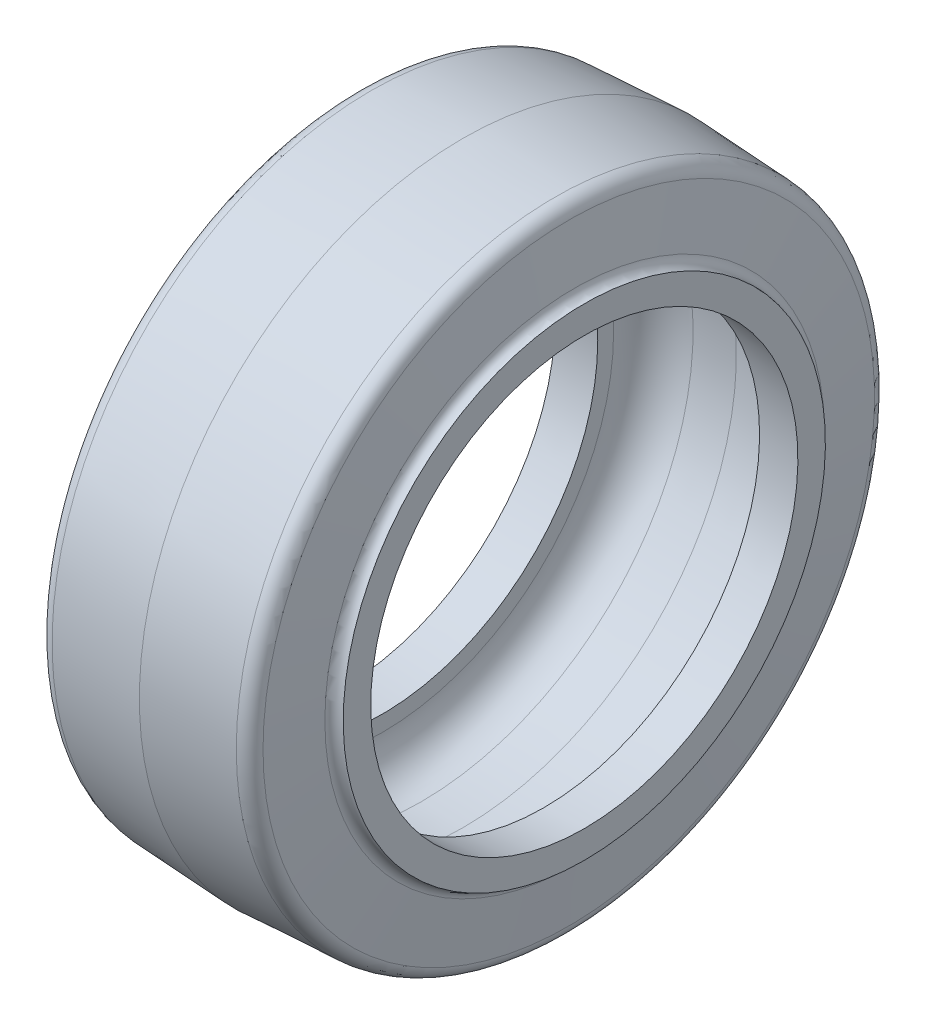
ISO-10303-21;
HEADER;
FILE_DESCRIPTION(('STEP AP214'),'2;1');
FILE_NAME('part.step','',(''),(''),'','','');
FILE_SCHEMA(('AUTOMOTIVE_DESIGN { 1 0 10303 214 1 1 1 1 }'));
ENDSEC;
DATA;
#1=APPLICATION_CONTEXT('core data for automotive mechanical design processes');
#2=APPLICATION_PROTOCOL_DEFINITION('international standard','automotive_design',2000,#1);
#3=PRODUCT_CONTEXT('',#1,'mechanical');
#4=PRODUCT('Part','Part','',(#3));
#5=PRODUCT_RELATED_PRODUCT_CATEGORY('part','',(#4));
#6=PRODUCT_DEFINITION_FORMATION('','',#4);
#7=PRODUCT_DEFINITION_CONTEXT('part definition',#1,'design');
#8=PRODUCT_DEFINITION('design','',#6,#7);
#9=PRODUCT_DEFINITION_SHAPE('','',#8);
#10=(LENGTH_UNIT() NAMED_UNIT(*) SI_UNIT(.MILLI.,.METRE.));
#11=(NAMED_UNIT(*) PLANE_ANGLE_UNIT() SI_UNIT($,.RADIAN.));
#12=(NAMED_UNIT(*) SI_UNIT($,.STERADIAN.) SOLID_ANGLE_UNIT());
#13=UNCERTAINTY_MEASURE_WITH_UNIT(LENGTH_MEASURE(1.E-05),#10,'distance_accuracy_value','');
#14=(GEOMETRIC_REPRESENTATION_CONTEXT(3) GLOBAL_UNCERTAINTY_ASSIGNED_CONTEXT((#13)) GLOBAL_UNIT_ASSIGNED_CONTEXT((#10,
#11,#12)) REPRESENTATION_CONTEXT('',''));
#15=CARTESIAN_POINT('',(0.,0.,0.));
#16=DIRECTION('',(0.,0.,1.));
#17=DIRECTION('',(1.,0.,0.));
#18=AXIS2_PLACEMENT_3D('',#15,#16,#17);
#19=CARTESIAN_POINT('',(0.,0.,0.));
#20=DIRECTION('',(1.,0.,0.));
#21=DIRECTION('',(0.,0.,-1.));
#22=AXIS2_PLACEMENT_3D('',#19,#20,#21);
#23=CONICAL_SURFACE('',#22,42.926,0.0349065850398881);
#24=CARTESIAN_POINT('',(0.,0.,0.));
#25=DIRECTION('',(-1.,0.,0.));
#26=DIRECTION('',(0.,-1.,0.));
#27=AXIS2_PLACEMENT_3D('',#24,#25,#26);
#28=CIRCLE('',#27,42.926);
#29=CARTESIAN_POINT('',(0.,-42.926,0.));
#30=VERTEX_POINT('',#29);
#31=EDGE_CURVE('E45',#30,#30,#28,.F.);
#32=ORIENTED_EDGE('',*,*,#31,.T.);
#33=EDGE_LOOP('',(#32));
#34=FACE_BOUND('',#33,.T.);
#35=CARTESIAN_POINT('',(-6.57161180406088,0.,0.));
#36=DIRECTION('',(-1.,0.,0.));
#37=DIRECTION('',(0.,0.,1.));
#38=AXIS2_PLACEMENT_3D('',#35,#36,#37);
#39=CIRCLE('',#38,42.6965142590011);
#40=CARTESIAN_POINT('',(-6.57161180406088,0.,42.6965142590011));
#41=VERTEX_POINT('',#40);
#42=EDGE_CURVE('E135',#41,#41,#39,.T.);
#43=ORIENTED_EDGE('',*,*,#42,.T.);
#44=EDGE_LOOP('',(#43));
#45=FACE_BOUND('',#44,.T.);
#46=ADVANCED_FACE('F15',(#34,#45),#23,.F.);
#47=CARTESIAN_POINT('',(0.,0.,0.));
#48=DIRECTION('',(-1.,0.,0.));
#49=DIRECTION('',(0.,-1.,0.));
#50=AXIS2_PLACEMENT_3D('',#47,#48,#49);
#51=CONICAL_SURFACE('',#50,42.926,0.0349065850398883);
#52=ORIENTED_EDGE('',*,*,#31,.F.);
#53=EDGE_LOOP('',(#52));
#54=FACE_BOUND('',#53,.T.);
#55=CARTESIAN_POINT('',(6.57161180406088,0.,0.));
#56=DIRECTION('',(1.,0.,0.));
#57=DIRECTION('',(0.,0.,-1.));
#58=AXIS2_PLACEMENT_3D('',#55,#56,#57);
#59=CIRCLE('',#58,42.6965142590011);
#60=CARTESIAN_POINT('',(6.57161180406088,0.,-42.6965142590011));
#61=VERTEX_POINT('',#60);
#62=EDGE_CURVE('E41',#61,#61,#59,.T.);
#63=ORIENTED_EDGE('',*,*,#62,.T.);
#64=EDGE_LOOP('',(#63));
#65=FACE_BOUND('',#64,.T.);
#66=ADVANCED_FACE('F123',(#54,#65),#51,.F.);
#67=CARTESIAN_POINT('',(-6.34999999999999,0.,0.));
#68=DIRECTION('',(-1.,0.,0.));
#69=DIRECTION('',(0.,0.,1.));
#70=AXIS2_PLACEMENT_3D('',#67,#68,#69);
#71=TOROIDAL_SURFACE('',#70,36.3503825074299,6.35);
#72=CARTESIAN_POINT('',(-12.7,0.,0.));
#73=DIRECTION('',(-1.,0.,0.));
#74=DIRECTION('',(0.,0.,1.));
#75=AXIS2_PLACEMENT_3D('',#72,#73,#74);
#76=CIRCLE('',#75,36.3503825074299);
#77=CARTESIAN_POINT('',(-12.7,0.,36.3503825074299));
#78=VERTEX_POINT('',#77);
#79=EDGE_CURVE('E19',#78,#78,#76,.F.);
#80=ORIENTED_EDGE('',*,*,#79,.F.);
#81=EDGE_LOOP('',(#80));
#82=FACE_BOUND('',#81,.T.);
#83=ORIENTED_EDGE('',*,*,#42,.F.);
#84=EDGE_LOOP('',(#83));
#85=FACE_BOUND('',#84,.T.);
#86=ADVANCED_FACE('F57',(#82,#85),#71,.F.);
#87=CARTESIAN_POINT('',(6.34999999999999,0.,0.));
#88=DIRECTION('',(-1.,0.,0.));
#89=DIRECTION('',(0.,0.,1.));
#90=AXIS2_PLACEMENT_3D('',#87,#88,#89);
#91=TOROIDAL_SURFACE('',#90,36.3503825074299,6.35);
#92=ORIENTED_EDGE('',*,*,#62,.F.);
#93=EDGE_LOOP('',(#92));
#94=FACE_BOUND('',#93,.T.);
#95=CARTESIAN_POINT('',(12.7,0.,-36.3503825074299));
#96=CARTESIAN_POINT('',(12.7,0.371293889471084,-36.3503844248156));
#97=CARTESIAN_POINT('',(12.7,0.742587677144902,-36.344693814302));
#98=CARTESIAN_POINT('',(12.7,1.48482669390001,-36.3219413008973));
#99=CARTESIAN_POINT('',(12.7,1.8557719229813,-36.3048793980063));
#100=CARTESIAN_POINT('',(12.7,2.59696546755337,-36.259398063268));
#101=CARTESIAN_POINT('',(12.7,2.96721378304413,-36.2309786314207));
#102=CARTESIAN_POINT('',(12.7,3.70666588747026,-36.1628095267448));
#103=CARTESIAN_POINT('',(12.7,4.07586967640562,-36.1230598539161));
#104=CARTESIAN_POINT('',(12.7,4.81288607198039,-36.0322674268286));
#105=CARTESIAN_POINT('',(12.7,5.1806986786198,-35.9812246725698));
#106=CARTESIAN_POINT('',(12.7,5.91458736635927,-35.8678940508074));
#107=CARTESIAN_POINT('',(12.7,6.28066344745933,-35.8056061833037));
#108=CARTESIAN_POINT('',(12.7,7.01073536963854,-35.6698438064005));
#109=CARTESIAN_POINT('',(12.7,7.3747312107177,-35.5963692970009));
#110=CARTESIAN_POINT('',(12.7,8.10030089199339,-35.4383026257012));
#111=CARTESIAN_POINT('',(12.7,8.46187473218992,-35.3537104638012));
#112=CARTESIAN_POINT('',(12.7,9.18226092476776,-35.1734879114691));
#113=CARTESIAN_POINT('',(12.7,9.54107327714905,-35.0778575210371));
#114=CARTESIAN_POINT('',(12.7,10.2555996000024,-34.8756483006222));
#115=CARTESIAN_POINT('',(12.7,10.6113135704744,-34.7690694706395));
#116=CARTESIAN_POINT('',(12.7,11.3193091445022,-34.545063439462));
#117=CARTESIAN_POINT('',(12.7,11.671590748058,-34.4276362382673));
#118=CARTESIAN_POINT('',(12.7,12.3723908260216,-34.1820437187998));
#119=CARTESIAN_POINT('',(12.7,12.7209093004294,-34.0538784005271));
#120=CARTESIAN_POINT('',(12.7,13.4138558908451,-33.7869299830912));
#121=CARTESIAN_POINT('',(12.7,13.7582840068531,-33.6481468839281));
#122=CARTESIAN_POINT('',(12.7,14.442726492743,-33.3600932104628));
#123=CARTESIAN_POINT('',(12.7,14.7827408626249,-33.2108226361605));
#124=CARTESIAN_POINT('',(12.7,15.4580366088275,-32.9019341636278));
#125=CARTESIAN_POINT('',(12.7,15.7933179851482,-32.7423162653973));
#126=CARTESIAN_POINT('',(12.7,16.4588329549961,-32.4128830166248));
#127=CARTESIAN_POINT('',(12.6999999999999,16.7890665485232,-32.2430676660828));
#128=CARTESIAN_POINT('',(12.7000000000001,17.4441758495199,-31.8933989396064));
#129=CARTESIAN_POINT('',(12.7000000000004,17.7690515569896,-31.713545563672));
#130=CARTESIAN_POINT('',(12.6999999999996,18.4131402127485,-31.3439697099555));
#131=CARTESIAN_POINT('',(12.6999999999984,18.7323531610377,-31.1542472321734));
#132=CARTESIAN_POINT('',(12.7000000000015,19.3648159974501,-30.7651110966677));
#133=CARTESIAN_POINT('',(12.7000000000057,19.6780658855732,-30.5656974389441));
#134=CARTESIAN_POINT('',(12.6999999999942,20.2983106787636,-30.1573669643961));
#135=CARTESIAN_POINT('',(12.6999999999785,20.6053055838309,-29.9484501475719));
#136=CARTESIAN_POINT('',(12.7000000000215,21.2127439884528,-29.5213065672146));
#137=CARTESIAN_POINT('',(12.7000000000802,21.5131874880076,-29.3030798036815));
#138=CARTESIAN_POINT('',(12.6999999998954,22.1974851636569,-28.7898743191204));
#139=CARTESIAN_POINT('',(12.6999999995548,22.5789594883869,-28.4917142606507));
#140=CARTESIAN_POINT('',(12.6999999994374,23.3297193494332,-27.8804216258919));
#141=CARTESIAN_POINT('',(12.6999999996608,23.6990048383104,-27.5672889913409));
#142=CARTESIAN_POINT('',(12.6999999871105,24.2887640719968,-27.0467571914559));
#143=CARTESIAN_POINT('',(12.699999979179,24.5131151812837,-26.8437384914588));
#144=CARTESIAN_POINT('',(12.6999999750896,24.8052098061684,-26.5725809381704));
#145=CARTESIAN_POINT('',(12.6999999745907,24.8753127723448,-26.5069740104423));
#146=CARTESIAN_POINT('',(12.6999999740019,25.3368394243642,-26.0715639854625));
#147=CARTESIAN_POINT('',(12.6999999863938,25.7202560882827,-25.6932022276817));
#148=CARTESIAN_POINT('',(12.7000000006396,26.5379708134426,-24.849572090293));
#149=CARTESIAN_POINT('',(12.7000000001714,26.9688652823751,-24.3809987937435));
#150=CARTESIAN_POINT('',(12.6999999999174,27.5888221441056,-23.6707053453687));
#151=CARTESIAN_POINT('',(12.6999999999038,27.787472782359,-23.4372823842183));
#152=CARTESIAN_POINT('',(12.6999999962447,28.228292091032,-22.9058606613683));
#153=CARTESIAN_POINT('',(12.6999999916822,28.4687696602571,-22.6064519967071));
#154=CARTESIAN_POINT('',(12.6999999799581,28.8601066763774,-22.1030736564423));
#155=CARTESIAN_POINT('',(12.6999999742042,29.0136801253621,-21.9012033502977));
#156=CARTESIAN_POINT('',(12.6999999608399,29.4246045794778,-21.3490891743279));
#157=CARTESIAN_POINT('',(12.6999999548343,29.6778167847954,-20.9957524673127));
#158=CARTESIAN_POINT('',(12.6999999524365,30.2600956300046,-20.1514876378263));
#159=CARTESIAN_POINT('',(12.6999999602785,30.5836923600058,-19.6567764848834));
#160=CARTESIAN_POINT('',(12.6999999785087,31.1717434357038,-18.7079583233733));
#161=CARTESIAN_POINT('',(12.6999999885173,31.4387742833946,-18.2554464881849));
#162=CARTESIAN_POINT('',(12.6999999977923,31.8243138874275,-17.5682899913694));
#163=CARTESIAN_POINT('',(12.6999999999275,31.9503289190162,-17.3378338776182));
#164=CARTESIAN_POINT('',(12.7000000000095,32.0900303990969,-17.0757378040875));
#165=CARTESIAN_POINT('',(12.6999999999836,32.1061514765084,-17.0453907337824));
#166=CARTESIAN_POINT('',(12.6999999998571,32.1892487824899,-16.8884414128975));
#167=CARTESIAN_POINT('',(12.6999999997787,32.2555383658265,-16.7614746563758));
#168=CARTESIAN_POINT('',(12.6999999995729,32.4320632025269,-16.418441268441));
#169=CARTESIAN_POINT('',(12.6999999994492,32.5408921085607,-16.20164974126));
#170=CARTESIAN_POINT('',(12.6999999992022,32.797869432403,-15.6767186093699));
#171=CARTESIAN_POINT('',(12.6999999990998,32.9438697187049,-15.3675256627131));
#172=CARTESIAN_POINT('',(12.6999999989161,33.2682328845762,-14.6547317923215));
#173=CARTESIAN_POINT('',(12.6999999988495,33.4436755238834,-14.2497991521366));
#174=CARTESIAN_POINT('',(12.6999999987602,33.8175268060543,-13.3419737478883));
#175=CARTESIAN_POINT('',(12.699999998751,34.0122156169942,-12.8375477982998));
#176=CARTESIAN_POINT('',(12.6999999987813,34.4126022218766,-11.7270400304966));
#177=CARTESIAN_POINT('',(12.6999999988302,34.6137511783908,-11.1193079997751));
#178=CARTESIAN_POINT('',(12.6999999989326,34.9019565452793,-10.1647884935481));
#179=CARTESIAN_POINT('',(12.6999999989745,35.0001610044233,-9.82132132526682));
#180=CARTESIAN_POINT('',(12.6999999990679,35.1928814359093,-9.10765693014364));
#181=CARTESIAN_POINT('',(12.6999999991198,35.2866664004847,-8.73726136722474));
#182=CARTESIAN_POINT('',(12.69999999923,35.4682279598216,-7.96953387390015));
#183=CARTESIAN_POINT('',(12.6999999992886,35.5552178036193,-7.57201596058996));
#184=CARTESIAN_POINT('',(12.6999999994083,35.7207041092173,-6.74993756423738));
#185=CARTESIAN_POINT('',(12.6999999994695,35.7983582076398,-6.32520729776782));
#186=CARTESIAN_POINT('',(12.6999999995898,35.9425185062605,-5.4487463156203));
#187=CARTESIAN_POINT('',(12.6999999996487,36.0081265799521,-4.99686775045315));
#188=CARTESIAN_POINT('',(12.6999999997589,36.1253791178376,-4.06631985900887));
#189=CARTESIAN_POINT('',(12.6999999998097,36.1760700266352,-3.58753015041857));
#190=CARTESIAN_POINT('',(12.6999999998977,36.2605195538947,-2.60357687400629));
#191=CARTESIAN_POINT('',(12.6999999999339,36.2932698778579,-2.09832682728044));
#192=CARTESIAN_POINT('',(12.6999999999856,36.3387282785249,-1.06207186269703));
#193=CARTESIAN_POINT('',(12.7,36.3503744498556,-0.531019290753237));
#194=CARTESIAN_POINT('',(12.7,36.3503867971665,0.2827070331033));
#195=CARTESIAN_POINT('',(12.6999999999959,36.3470924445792,0.565404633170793));
#196=CARTESIAN_POINT('',(12.6999999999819,36.3339098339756,1.13064557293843));
#197=CARTESIAN_POINT('',(12.699999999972,36.3240215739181,1.41318891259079));
#198=CARTESIAN_POINT('',(12.6999999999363,36.2844712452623,2.26035100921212));
#199=CARTESIAN_POINT('',(12.6999999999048,36.2449236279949,2.82454013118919));
#200=CARTESIAN_POINT('',(12.6999999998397,36.1395542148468,3.95043687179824));
#201=CARTESIAN_POINT('',(12.6999999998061,36.073732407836,4.51214448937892));
#202=CARTESIAN_POINT('',(12.6999999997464,35.9159572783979,5.63188400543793));
#203=CARTESIAN_POINT('',(12.6999999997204,35.8240039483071,6.18991590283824));
#204=CARTESIAN_POINT('',(12.6999999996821,35.6141661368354,7.30108114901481));
#205=CARTESIAN_POINT('',(12.6999999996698,35.4962816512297,7.85421449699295));
#206=CARTESIAN_POINT('',(12.6999999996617,35.2348381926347,8.95438049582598));
#207=CARTESIAN_POINT('',(12.6999999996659,35.0912792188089,9.50141314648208));
#208=CARTESIAN_POINT('',(12.6999999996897,34.7787992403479,10.5881854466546));
#209=CARTESIAN_POINT('',(12.6999999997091,34.6098782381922,11.127925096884));
#210=CARTESIAN_POINT('',(12.6999999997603,34.2470425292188,12.19893872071));
#211=CARTESIAN_POINT('',(12.6999999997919,34.0531278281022,12.7302126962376));
#212=CARTESIAN_POINT('',(12.6999999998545,33.6407250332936,13.7831291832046));
#213=CARTESIAN_POINT('',(12.6999999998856,33.4222369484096,14.3047716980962));
#214=CARTESIAN_POINT('',(12.6999999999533,32.9611703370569,15.3373228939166));
#215=CARTESIAN_POINT('',(12.69999999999,32.7185918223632,15.8482315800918));
#216=CARTESIAN_POINT('',(12.6999999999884,32.337023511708,16.6056336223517));
#217=CARTESIAN_POINT('',(12.6999999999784,32.2068792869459,16.8566158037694));
#218=CARTESIAN_POINT('',(12.7000000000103,32.0105203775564,17.2248601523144));
#219=CARTESIAN_POINT('',(12.7000000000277,31.9465233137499,17.3433096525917));
#220=CARTESIAN_POINT('',(12.6999999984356,31.5677322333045,18.0352165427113));
#221=CARTESIAN_POINT('',(12.6999999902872,31.2381116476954,18.6006848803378));
#222=CARTESIAN_POINT('',(12.6999999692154,30.6090888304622,19.6156122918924));
#223=CARTESIAN_POINT('',(12.6999999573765,30.3144861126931,20.068062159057));
#224=CARTESIAN_POINT('',(12.6999999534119,29.8707358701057,20.7172920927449));
#225=CARTESIAN_POINT('',(12.6999999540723,29.7294772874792,20.9194859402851));
#226=CARTESIAN_POINT('',(12.6999999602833,29.5086198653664,21.228780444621));
#227=CARTESIAN_POINT('',(12.69999996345,29.4304816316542,21.3369279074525));
#228=CARTESIAN_POINT('',(12.6999999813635,28.9659146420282,21.9724880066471));
#229=CARTESIAN_POINT('',(12.6999999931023,28.565725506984,22.4899849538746));
#230=CARTESIAN_POINT('',(12.7000000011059,27.8366953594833,23.3820901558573));
#231=CARTESIAN_POINT('',(12.7000000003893,27.5135501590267,23.7613855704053));
#232=CARTESIAN_POINT('',(12.6999999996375,27.0097513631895,24.3289009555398));
#233=CARTESIAN_POINT('',(12.6999999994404,26.8346005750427,24.5220184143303));
#234=CARTESIAN_POINT('',(12.6999999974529,26.4929268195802,24.8907050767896));
#235=CARTESIAN_POINT('',(12.6999999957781,26.3266882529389,25.0665381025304));
#236=CARTESIAN_POINT('',(12.6999999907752,25.8227396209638,25.588987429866));
#237=CARTESIAN_POINT('',(12.6999999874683,25.4797818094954,25.9305706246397));
#238=CARTESIAN_POINT('',(12.699999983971,24.7804749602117,26.5997222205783));
#239=CARTESIAN_POINT('',(12.6999999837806,24.4241258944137,26.9272905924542));
#240=CARTESIAN_POINT('',(12.6999999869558,23.698617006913,27.5679221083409));
#241=CARTESIAN_POINT('',(12.6999999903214,23.3294572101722,27.8809852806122));
#242=CARTESIAN_POINT('',(12.6999999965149,22.5788346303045,28.4920051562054));
#243=CARTESIAN_POINT('',(12.6999999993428,22.1973719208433,28.7899619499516));
#244=CARTESIAN_POINT('',(12.700000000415,21.565761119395,29.2636492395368));
#245=CARTESIAN_POINT('',(12.6999999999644,21.319027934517,29.4439568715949));
#246=CARTESIAN_POINT('',(12.6999999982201,20.7829235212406,29.8254312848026));
#247=CARTESIAN_POINT('',(12.6999999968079,20.4928116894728,30.0255611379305));
#248=CARTESIAN_POINT('',(12.699999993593,20.0077948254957,30.349837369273));
#249=CARTESIAN_POINT('',(12.6999999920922,19.8145081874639,30.4764165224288));
#250=CARTESIAN_POINT('',(12.6999999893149,19.2618212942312,30.8308391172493));
#251=CARTESIAN_POINT('',(12.6999999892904,18.8995506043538,31.0542323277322));
#252=CARTESIAN_POINT('',(12.6999999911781,18.1661784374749,31.4888358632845));
#253=CARTESIAN_POINT('',(12.6999999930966,17.7950518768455,31.7000037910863));
#254=CARTESIAN_POINT('',(12.6999999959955,17.0455936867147,32.109142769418));
#255=CARTESIAN_POINT('',(12.6999999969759,16.6672620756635,32.3071138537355));
#256=CARTESIAN_POINT('',(12.6999999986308,15.9038529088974,32.6895958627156));
#257=CARTESIAN_POINT('',(12.6999999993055,15.518775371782,32.8741068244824));
#258=CARTESIAN_POINT('',(12.7000000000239,14.7744965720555,33.2147654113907));
#259=CARTESIAN_POINT('',(12.7000000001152,14.4157900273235,33.371996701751));
#260=CARTESIAN_POINT('',(12.6999999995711,13.603208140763,33.7127178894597));
#261=CARTESIAN_POINT('',(12.6999999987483,13.1479573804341,33.8929469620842));
#262=CARTESIAN_POINT('',(12.6999999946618,12.413766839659,34.1665668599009));
#263=CARTESIAN_POINT('',(12.6999999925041,12.13701891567,34.2658941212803));
#264=CARTESIAN_POINT('',(12.6999999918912,11.488524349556,34.4897339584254));
#265=CARTESIAN_POINT('',(12.6999999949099,11.1158588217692,34.6116063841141));
#266=CARTESIAN_POINT('',(12.6999999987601,10.5540345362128,34.7851950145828));
#267=CARTESIAN_POINT('',(12.6999999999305,10.3662861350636,34.8415219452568));
#268=CARTESIAN_POINT('',(12.7000000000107,10.1491527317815,34.9048060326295));
#269=CARTESIAN_POINT('',(12.6999999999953,10.1201881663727,34.913209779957));
#270=CARTESIAN_POINT('',(12.6999999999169,9.94607256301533,34.9634979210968));
#271=CARTESIAN_POINT('',(12.6999999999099,9.80067537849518,35.0045333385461));
#272=CARTESIAN_POINT('',(12.6999999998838,9.3927201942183,35.116925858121));
#273=CARTESIAN_POINT('',(12.6999999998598,9.12959843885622,35.1862437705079));
#274=CARTESIAN_POINT('',(12.6999999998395,8.48451615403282,35.3484717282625));
#275=CARTESIAN_POINT('',(12.6999999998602,8.10174420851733,35.4381644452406));
#276=CARTESIAN_POINT('',(12.6999999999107,7.2152403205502,35.6307793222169));
#277=CARTESIAN_POINT('',(12.6999999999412,6.71054073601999,35.72927604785));
#278=CARTESIAN_POINT('',(12.699999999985,5.74582014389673,35.8963926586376));
#279=CARTESIAN_POINT('',(12.6999999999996,5.28613633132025,35.9669676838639));
#280=CARTESIAN_POINT('',(12.7000000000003,4.4445766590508,36.0796895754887));
#281=CARTESIAN_POINT('',(12.699999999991,4.06307578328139,36.1246460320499));
#282=CARTESIAN_POINT('',(12.699999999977,3.37526706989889,36.1946620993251));
#283=CARTESIAN_POINT('',(12.6999999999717,3.06917970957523,36.221902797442));
#284=CARTESIAN_POINT('',(12.6999999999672,2.45641109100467,36.2686124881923));
#285=CARTESIAN_POINT('',(12.699999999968,2.14972983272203,36.288081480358));
#286=CARTESIAN_POINT('',(12.6999999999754,1.5359725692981,36.3192345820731));
#287=CARTESIAN_POINT('',(12.699999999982,1.2288965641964,36.3309186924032));
#288=CARTESIAN_POINT('',(12.6999999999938,0.61454709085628,36.3464956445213));
#289=CARTESIAN_POINT('',(12.699999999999,0.307273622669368,36.350388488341));
#290=CARTESIAN_POINT('',(12.7,0.,36.3503825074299));
#291=B_SPLINE_CURVE_WITH_KNOTS('',3,(#95,#96,#97,#98,#99,#100,#101,#102,#103,#104,#105,#106,
#107,#108,#109,#110,#111,#112,#113,#114,#115,#116,#117,#118,#119,#120,#121,#122,#123,#124,#125,
#126,#127,#128,#129,#130,#131,#132,#133,#134,#135,#136,#137,#138,#139,#140,#141,#142,#143,#144,
#145,#146,#147,#148,#149,#150,#151,#152,#153,#154,#155,#156,#157,#158,#159,#160,#161,#162,#163,
#164,#165,#166,#167,#168,#169,#170,#171,#172,#173,#174,#175,#176,#177,#178,#179,#180,#181,#182,
#183,#184,#185,#186,#187,#188,#189,#190,#191,#192,#193,#194,#195,#196,#197,#198,#199,#200,#201,
#202,#203,#204,#205,#206,#207,#208,#209,#210,#211,#212,#213,#214,#215,#216,#217,#218,#219,#220,
#221,#222,#223,#224,#225,#226,#227,#228,#229,#230,#231,#232,#233,#234,#235,#236,#237,#238,#239,
#240,#241,#242,#243,#244,#245,#246,#247,#248,#249,#250,#251,#252,#253,#254,#255,#256,#257,#258,
#259,#260,#261,#262,#263,#264,#265,#266,#267,#268,#269,#270,#271,#272,#273,#274,#275,#276,#277,
#278,#279,#280,#281,#282,#283,#284,#285,#286,#287,#288,#289,#290),.UNSPECIFIED.,.F.,.F.,(4,2,2,
2,2,2,2,2,2,2,2,2,2,2,2,2,2,2,2,2,2,2,2,2,2,2,2,2,2,2,2,2,2,2,2,2,2,2,2,2,2,2,2,2,2,2,2,2,2,2,2,
2,2,2,2,2,2,2,2,2,2,2,2,2,2,2,2,2,2,2,2,2,2,2,2,2,2,2,2,2,2,2,2,2,2,2,2,2,2,2,2,2,2,2,2,2,2,4),
(0.,1.11383791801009,2.22767583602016,3.34151375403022,4.45535167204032,5.56918959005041,
6.68302750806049,7.79686542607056,8.91070334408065,10.0245412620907,11.1383791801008,
12.2522170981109,13.366055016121,14.479892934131,15.5937308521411,16.7075687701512,
17.8214066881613,18.9352446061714,20.0490825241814,21.1629204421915,22.2767583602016,
23.3905962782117,24.8427142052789,26.2948377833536,27.2024573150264,27.4904986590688,
29.1059321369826,31.0147123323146,31.9341714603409,33.0860234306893,33.8469179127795,
35.1507275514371,36.923433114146,38.4991918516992,39.2871103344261,39.390200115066,
39.8198803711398,40.5475546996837,41.5732105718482,42.8968306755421,44.5183929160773,
46.4378704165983,47.5094335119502,48.6554891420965,49.8760362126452,51.1710735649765,
52.5405999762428,53.9846141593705,55.5031147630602,57.0961003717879,57.9441829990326,
58.7922658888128,60.488316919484,62.1843686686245,63.8804209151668,65.5764734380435,
67.272526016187,68.9685784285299,70.6646304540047,72.360681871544,74.0567324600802,
74.904815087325,75.3087106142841,77.2711762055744,78.8903695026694,79.6302685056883,
80.0305328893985,81.9919481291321,83.4864090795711,84.2684956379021,84.9943842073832,
86.4460945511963,87.8978079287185,89.3495184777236,90.8012203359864,91.7179248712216,
92.7750868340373,93.4681919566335,94.7447348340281,96.0254679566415,97.3061978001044,
98.586924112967,99.7616995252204,101.23013559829,102.112166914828,103.288184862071,
103.876210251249,103.966687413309,104.419906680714,105.236135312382,106.415353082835,
107.957531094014,109.352400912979,110.504628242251,111.426424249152,112.348220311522,
113.270016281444,114.191812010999),.UNSPECIFIED.);
#292=CARTESIAN_POINT('',(12.7,0.,-36.3503825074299));
#293=VERTEX_POINT('',#292);
#294=CARTESIAN_POINT('',(12.7,0.,36.3503825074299));
#295=VERTEX_POINT('',#294);
#296=EDGE_CURVE('E31',#293,#295,#291,.T.);
#297=ORIENTED_EDGE('',*,*,#296,.T.);
#298=CARTESIAN_POINT('',(12.7,0.,36.3503825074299));
#299=CARTESIAN_POINT('',(12.7,-0.371293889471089,36.3503844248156));
#300=CARTESIAN_POINT('',(12.7,-0.742587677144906,36.344693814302));
#301=CARTESIAN_POINT('',(12.7,-1.48482669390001,36.3219413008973));
#302=CARTESIAN_POINT('',(12.7,-1.8557719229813,36.3048793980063));
#303=CARTESIAN_POINT('',(12.7,-2.59696546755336,36.259398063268));
#304=CARTESIAN_POINT('',(12.7,-2.96721378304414,36.2309786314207));
#305=CARTESIAN_POINT('',(12.7,-3.70666588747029,36.1628095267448));
#306=CARTESIAN_POINT('',(12.7,-4.07586967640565,36.1230598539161));
#307=CARTESIAN_POINT('',(12.7,-4.81288607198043,36.0322674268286));
#308=CARTESIAN_POINT('',(12.7,-5.18069867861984,35.9812246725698));
#309=CARTESIAN_POINT('',(12.7,-5.91458736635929,35.8678940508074));
#310=CARTESIAN_POINT('',(12.7,-6.28066344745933,35.8056061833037));
#311=CARTESIAN_POINT('',(12.7,-7.01073536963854,35.6698438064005));
#312=CARTESIAN_POINT('',(12.7,-7.3747312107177,35.5963692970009));
#313=CARTESIAN_POINT('',(12.7,-8.10030089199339,35.4383026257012));
#314=CARTESIAN_POINT('',(12.7,-8.46187473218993,35.3537104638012));
#315=CARTESIAN_POINT('',(12.7,-9.18226092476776,35.1734879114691));
#316=CARTESIAN_POINT('',(12.7,-9.54107327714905,35.0778575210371));
#317=CARTESIAN_POINT('',(12.7,-10.2555996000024,34.8756483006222));
#318=CARTESIAN_POINT('',(12.7,-10.6113135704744,34.7690694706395));
#319=CARTESIAN_POINT('',(12.7,-11.3193091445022,34.545063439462));
#320=CARTESIAN_POINT('',(12.7,-11.671590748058,34.4276362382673));
#321=CARTESIAN_POINT('',(12.7,-12.3723908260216,34.1820437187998));
#322=CARTESIAN_POINT('',(12.7,-12.7209093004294,34.0538784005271));
#323=CARTESIAN_POINT('',(12.7,-13.4138558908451,33.7869299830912));
#324=CARTESIAN_POINT('',(12.7,-13.7582840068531,33.6481468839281));
#325=CARTESIAN_POINT('',(12.7,-14.442726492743,33.3600932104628));
#326=CARTESIAN_POINT('',(12.7,-14.7827408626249,33.2108226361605));
#327=CARTESIAN_POINT('',(12.7,-15.4580366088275,32.9019341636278));
#328=CARTESIAN_POINT('',(12.7,-15.7933179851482,32.7423162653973));
#329=CARTESIAN_POINT('',(12.7,-16.4588329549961,32.4128830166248));
#330=CARTESIAN_POINT('',(12.6999999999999,-16.7890665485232,32.2430676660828));
#331=CARTESIAN_POINT('',(12.7000000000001,-17.44417584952,31.8933989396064));
#332=CARTESIAN_POINT('',(12.7000000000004,-17.7690515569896,31.713545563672));
#333=CARTESIAN_POINT('',(12.6999999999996,-18.4131402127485,31.3439697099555));
#334=CARTESIAN_POINT('',(12.6999999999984,-18.7323531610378,31.1542472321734));
#335=CARTESIAN_POINT('',(12.7000000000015,-19.3648159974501,30.7651110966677));
#336=CARTESIAN_POINT('',(12.7000000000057,-19.6780658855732,30.565697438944));
#337=CARTESIAN_POINT('',(12.6999999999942,-20.2983106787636,30.1573669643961));
#338=CARTESIAN_POINT('',(12.6999999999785,-20.6053055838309,29.9484501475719));
#339=CARTESIAN_POINT('',(12.7000000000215,-21.2127439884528,29.5213065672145));
#340=CARTESIAN_POINT('',(12.7000000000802,-21.5131874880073,29.3030798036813));
#341=CARTESIAN_POINT('',(12.6999999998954,-22.1974851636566,28.7898743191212));
#342=CARTESIAN_POINT('',(12.6999999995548,-22.5789594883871,28.4917142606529));
#343=CARTESIAN_POINT('',(12.6999999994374,-23.3297193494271,27.8804216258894));
#344=CARTESIAN_POINT('',(12.6999999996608,-23.6990048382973,27.5672889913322));
#345=CARTESIAN_POINT('',(12.6999999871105,-24.2887640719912,27.0467571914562));
#346=CARTESIAN_POINT('',(12.699999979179,-24.5131151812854,26.8437384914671));
#347=CARTESIAN_POINT('',(12.6999999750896,-24.8052097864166,26.5725809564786));
#348=CARTESIAN_POINT('',(12.6999999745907,-24.8753127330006,26.5069740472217));
#349=CARTESIAN_POINT('',(12.6999999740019,-25.3368393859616,26.0715640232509));
#350=CARTESIAN_POINT('',(12.6999999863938,-25.7202560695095,25.693202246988));
#351=CARTESIAN_POINT('',(12.7000000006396,-26.5379708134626,24.8495720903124));
#352=CARTESIAN_POINT('',(12.7000000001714,-26.9688652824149,24.3809987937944));
#353=CARTESIAN_POINT('',(12.6999999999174,-27.5888221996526,23.6707052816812));
#354=CARTESIAN_POINT('',(12.6999999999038,-27.7874728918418,23.437282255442));
#355=CARTESIAN_POINT('',(12.6999999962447,-28.2282921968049,22.9058605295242));
#356=CARTESIAN_POINT('',(12.6999999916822,-28.4687697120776,22.6064519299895));
#357=CARTESIAN_POINT('',(12.6999999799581,-28.8601066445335,22.1030736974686));
#358=CARTESIAN_POINT('',(12.6999999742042,-29.0136800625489,21.9012034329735));
#359=CARTESIAN_POINT('',(12.6999999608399,-29.4246045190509,21.3490892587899));
#360=CARTESIAN_POINT('',(12.6999999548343,-29.6778167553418,20.9957525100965));
#361=CARTESIAN_POINT('',(12.6999999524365,-30.2600956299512,20.1514876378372));
#362=CARTESIAN_POINT('',(12.6999999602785,-30.583692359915,19.6567764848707));
#363=CARTESIAN_POINT('',(12.6999999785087,-31.17174343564,18.7079583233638));
#364=CARTESIAN_POINT('',(12.6999999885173,-31.4387742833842,18.2554464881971));
#365=CARTESIAN_POINT('',(12.6999999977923,-31.8243138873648,17.5682899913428));
#366=CARTESIAN_POINT('',(12.6999999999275,-31.950328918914,17.3378338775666));
#367=CARTESIAN_POINT('',(12.7000000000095,-32.0900303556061,17.0757378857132));
#368=CARTESIAN_POINT('',(12.6999999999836,-32.1061513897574,17.0453908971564));
#369=CARTESIAN_POINT('',(12.6999999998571,-32.1892485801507,16.8884417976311));
#370=CARTESIAN_POINT('',(12.6999999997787,-32.2555380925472,16.7614751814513));
#371=CARTESIAN_POINT('',(12.6999999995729,-32.4320628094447,16.4184420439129));
#372=CARTESIAN_POINT('',(12.6999999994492,-32.5408916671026,16.2016506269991));
#373=CARTESIAN_POINT('',(12.6999999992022,-32.7978689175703,15.6767196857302));
#374=CARTESIAN_POINT('',(12.6999999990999,-32.9438691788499,15.3675268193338));
#375=CARTESIAN_POINT('',(12.6999999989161,-33.2682323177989,14.654733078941));
#376=CARTESIAN_POINT('',(12.6999999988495,-33.4436749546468,14.2498004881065));
#377=CARTESIAN_POINT('',(12.6999999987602,-33.8175262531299,13.3419751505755));
#378=CARTESIAN_POINT('',(12.699999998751,-34.0122150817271,12.8375492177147));
#379=CARTESIAN_POINT('',(12.6999999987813,-34.4126017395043,11.7270414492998));
#380=CARTESIAN_POINT('',(12.6999999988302,-34.6137507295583,11.119309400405));
#381=CARTESIAN_POINT('',(12.6999999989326,-34.901956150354,10.1647898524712));
#382=CARTESIAN_POINT('',(12.6999999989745,-35.0001606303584,9.82132266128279));
#383=CARTESIAN_POINT('',(12.6999999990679,-35.1928811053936,9.10765821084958));
#384=CARTESIAN_POINT('',(12.6999999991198,-35.286666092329,8.73726261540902));
#385=CARTESIAN_POINT('',(12.69999999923,-35.4682276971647,7.96953504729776));
#386=CARTESIAN_POINT('',(12.6999999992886,-35.5552175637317,7.57201709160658));
#387=CARTESIAN_POINT('',(12.6999999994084,-35.7207039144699,6.7499386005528));
#388=CARTESIAN_POINT('',(12.6999999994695,-35.7983580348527,6.32520828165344));
#389=CARTESIAN_POINT('',(12.6999999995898,-35.942518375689,5.44874718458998));
#390=CARTESIAN_POINT('',(12.6999999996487,-36.0081264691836,4.9968685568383));
#391=CARTESIAN_POINT('',(12.6999999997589,-36.1253790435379,4.06632053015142));
#392=CARTESIAN_POINT('',(12.6999999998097,-36.1760699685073,3.5875307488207));
#393=CARTESIAN_POINT('',(12.6999999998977,-36.2605195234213,2.60357731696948));
#394=CARTESIAN_POINT('',(12.6999999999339,-36.2932698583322,2.09832718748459));
#395=CARTESIAN_POINT('',(12.6999999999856,-36.3387282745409,1.06207204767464));
#396=CARTESIAN_POINT('',(12.7,-36.3503744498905,0.53101938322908));
#397=CARTESIAN_POINT('',(12.7,-36.3503867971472,-0.282707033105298));
#398=CARTESIAN_POINT('',(12.6999999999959,-36.3470924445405,-0.565404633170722));
#399=CARTESIAN_POINT('',(12.6999999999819,-36.3339098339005,-1.13064557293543));
#400=CARTESIAN_POINT('',(12.699999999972,-36.3240215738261,-1.41318891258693));
#401=CARTESIAN_POINT('',(12.6999999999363,-36.2844712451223,-2.26035100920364));
#402=CARTESIAN_POINT('',(12.6999999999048,-36.2449236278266,-2.82454013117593));
#403=CARTESIAN_POINT('',(12.6999999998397,-36.1395542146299,-3.95043687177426));
#404=CARTESIAN_POINT('',(12.6999999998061,-36.0737324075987,-4.51214448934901));
#405=CARTESIAN_POINT('',(12.6999999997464,-35.915957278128,-5.63188400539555));
#406=CARTESIAN_POINT('',(12.6999999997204,-35.8240039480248,-6.18991590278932));
#407=CARTESIAN_POINT('',(12.6999999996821,-35.6141661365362,-7.30108114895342));
#408=CARTESIAN_POINT('',(12.6999999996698,-35.4962816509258,-7.85421449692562));
#409=CARTESIAN_POINT('',(12.6999999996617,-35.2348381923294,-8.95438049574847));
#410=CARTESIAN_POINT('',(12.699999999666,-35.0912792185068,-9.50141314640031));
#411=CARTESIAN_POINT('',(12.6999999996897,-34.7787992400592,-10.5881854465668));
#412=CARTESIAN_POINT('',(12.6999999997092,-34.6098782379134,-11.1279250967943));
#413=CARTESIAN_POINT('',(12.6999999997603,-34.2470425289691,-12.1989387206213));
#414=CARTESIAN_POINT('',(12.6999999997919,-34.0531278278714,-12.7302126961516));
#415=CARTESIAN_POINT('',(12.6999999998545,-33.6407250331,-13.7831291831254));
#416=CARTESIAN_POINT('',(12.6999999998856,-33.4222369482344,-14.3047716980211));
#417=CARTESIAN_POINT('',(12.6999999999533,-32.961170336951,-15.3373228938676));
#418=CARTESIAN_POINT('',(12.69999999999,-32.7185918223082,-15.8482315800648));
#419=CARTESIAN_POINT('',(12.6999999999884,-32.3370235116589,-16.6056336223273));
#420=CARTESIAN_POINT('',(12.6999999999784,-32.206879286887,-16.8566158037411));
#421=CARTESIAN_POINT('',(12.7000000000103,-32.0105204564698,-17.2248600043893));
#422=CARTESIAN_POINT('',(12.7000000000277,-31.9465234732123,-17.3433093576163));
#423=CARTESIAN_POINT('',(12.6999999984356,-31.5677324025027,-18.0352162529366));
#424=CARTESIAN_POINT('',(12.6999999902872,-31.2381117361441,-18.6006847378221));
#425=CARTESIAN_POINT('',(12.6999999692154,-30.6090888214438,-19.6156123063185));
#426=CARTESIAN_POINT('',(12.6999999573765,-30.314486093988,-20.0680621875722));
#427=CARTESIAN_POINT('',(12.6999999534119,-29.8707358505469,-20.7172921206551));
#428=CARTESIAN_POINT('',(12.6999999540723,-29.7294772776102,-20.9194859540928));
#429=CARTESIAN_POINT('',(12.6999999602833,-29.5086198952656,-21.2287804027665));
#430=CARTESIAN_POINT('',(12.69999996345,-29.4304816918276,-21.3369278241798));
#431=CARTESIAN_POINT('',(12.6999999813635,-28.9659147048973,-21.9724879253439));
#432=CARTESIAN_POINT('',(12.6999999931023,-28.5657255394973,-22.4899849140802));
#433=CARTESIAN_POINT('',(12.7000000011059,-27.8366953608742,-23.3820901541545));
#434=CARTESIAN_POINT('',(12.7000000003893,-27.5135501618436,-23.761385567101));
#435=CARTESIAN_POINT('',(12.6999999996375,-27.0097513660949,-24.3289009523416));
#436=CARTESIAN_POINT('',(12.6999999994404,-26.8346005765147,-24.5220184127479));
#437=CARTESIAN_POINT('',(12.6999999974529,-26.4929268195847,-24.8907050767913));
#438=CARTESIAN_POINT('',(12.6999999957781,-26.3266882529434,-25.066538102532));
#439=CARTESIAN_POINT('',(12.6999999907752,-25.822739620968,-25.5889874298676));
#440=CARTESIAN_POINT('',(12.6999999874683,-25.4797818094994,-25.9305706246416));
#441=CARTESIAN_POINT('',(12.699999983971,-24.780474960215,-26.59972222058));
#442=CARTESIAN_POINT('',(12.6999999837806,-24.4241258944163,-26.9272905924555));
#443=CARTESIAN_POINT('',(12.6999999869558,-23.6986170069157,-27.5679221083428));
#444=CARTESIAN_POINT('',(12.6999999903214,-23.3294572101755,-27.8809852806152));
#445=CARTESIAN_POINT('',(12.6999999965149,-22.578834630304,-28.4920051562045));
#446=CARTESIAN_POINT('',(12.6999999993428,-22.1973719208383,-28.7899619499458));
#447=CARTESIAN_POINT('',(12.700000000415,-21.5657611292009,-29.2636492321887));
#448=CARTESIAN_POINT('',(12.6999999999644,-21.3190279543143,-29.4439568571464));
#449=CARTESIAN_POINT('',(12.6999999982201,-20.7829235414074,-29.8254312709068));
#450=CARTESIAN_POINT('',(12.6999999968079,-20.4928116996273,-30.0255611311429));
#451=CARTESIAN_POINT('',(12.699999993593,-20.0077947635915,-30.3498374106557));
#452=CARTESIAN_POINT('',(12.6999999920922,-19.8145080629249,-30.4764166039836));
#453=CARTESIAN_POINT('',(12.6999999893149,-19.261821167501,-30.8308391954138));
#454=CARTESIAN_POINT('',(12.6999999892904,-18.8995505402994,-31.0542323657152));
#455=CARTESIAN_POINT('',(12.6999999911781,-18.1661784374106,-31.488835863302));
#456=CARTESIAN_POINT('',(12.6999999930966,-17.7950518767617,-31.700003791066));
#457=CARTESIAN_POINT('',(12.6999999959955,-17.04559368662,-32.1091427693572));
#458=CARTESIAN_POINT('',(12.6999999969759,-16.6672620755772,-32.3071138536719));
#459=CARTESIAN_POINT('',(12.6999999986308,-15.9038529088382,-32.6895958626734));
#460=CARTESIAN_POINT('',(12.6999999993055,-15.5187753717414,-32.8741068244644));
#461=CARTESIAN_POINT('',(12.7000000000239,-14.7744965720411,-33.2147654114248));
#462=CARTESIAN_POINT('',(12.7000000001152,-14.4157900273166,-33.3719967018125));
#463=CARTESIAN_POINT('',(12.6999999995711,-13.6032081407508,-33.7127178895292));
#464=CARTESIAN_POINT('',(12.6999999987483,-13.1479573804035,-33.8929469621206));
#465=CARTESIAN_POINT('',(12.6999999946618,-12.4137668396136,-34.1665668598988));
#466=CARTESIAN_POINT('',(12.6999999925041,-12.1370189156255,-34.2658941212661));
#467=CARTESIAN_POINT('',(12.6999999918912,-11.4885243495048,-34.4897339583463));
#468=CARTESIAN_POINT('',(12.6999999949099,-11.1158588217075,-34.61160638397));
#469=CARTESIAN_POINT('',(12.6999999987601,-10.55403453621,-34.785195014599));
#470=CARTESIAN_POINT('',(12.6999999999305,-10.3662861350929,-34.8415219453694));
#471=CARTESIAN_POINT('',(12.7000000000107,-10.1491526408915,-34.9048060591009));
#472=CARTESIAN_POINT('',(12.6999999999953,-10.1201879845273,-34.9132098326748));
#473=CARTESIAN_POINT('',(12.6999999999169,-9.94607216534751,-34.9634980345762));
#474=CARTESIAN_POINT('',(12.6999999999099,-9.80067485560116,-35.0045334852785));
#475=CARTESIAN_POINT('',(12.6999999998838,-9.39271949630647,-35.1169260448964));
#476=CARTESIAN_POINT('',(12.6999999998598,-9.12959769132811,-35.1862439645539));
#477=CARTESIAN_POINT('',(12.6999999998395,-8.4845153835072,-35.3484719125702));
#478=CARTESIAN_POINT('',(12.6999999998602,-8.10174346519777,-35.438164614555));
#479=CARTESIAN_POINT('',(12.6999999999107,-7.21523970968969,-35.6307794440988));
#480=CARTESIAN_POINT('',(12.6999999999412,-6.71054023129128,-35.7292761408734));
#481=CARTESIAN_POINT('',(12.699999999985,-5.74581987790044,-35.8963926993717));
#482=CARTESIAN_POINT('',(12.6999999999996,-5.28613619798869,-35.9669677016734));
#483=CARTESIAN_POINT('',(12.7000000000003,-4.44457665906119,-36.0796895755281));
#484=CARTESIAN_POINT('',(12.699999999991,-4.06307578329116,-36.1246460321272));
#485=CARTESIAN_POINT('',(12.699999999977,-3.37526706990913,-36.1946620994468));
#486=CARTESIAN_POINT('',(12.6999999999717,-3.06917970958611,-36.221902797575));
#487=CARTESIAN_POINT('',(12.6999999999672,-2.45641109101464,-36.2686124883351));
#488=CARTESIAN_POINT('',(12.699999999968,-2.14972983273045,-36.2880814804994));
#489=CARTESIAN_POINT('',(12.6999999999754,-1.53597256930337,-36.3192345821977));
#490=CARTESIAN_POINT('',(12.699999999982,-1.22889656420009,-36.3309186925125));
#491=CARTESIAN_POINT('',(12.6999999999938,-0.614547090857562,-36.3464956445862));
#492=CARTESIAN_POINT('',(12.699999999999,-0.307273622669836,-36.3503884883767));
#493=CARTESIAN_POINT('',(12.7,0.,-36.3503825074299));
#494=B_SPLINE_CURVE_WITH_KNOTS('',3,(#298,#299,#300,#301,#302,#303,#304,#305,#306,#307,#308,
#309,#310,#311,#312,#313,#314,#315,#316,#317,#318,#319,#320,#321,#322,#323,#324,#325,#326,#327,
#328,#329,#330,#331,#332,#333,#334,#335,#336,#337,#338,#339,#340,#341,#342,#343,#344,#345,#346,
#347,#348,#349,#350,#351,#352,#353,#354,#355,#356,#357,#358,#359,#360,#361,#362,#363,#364,#365,
#366,#367,#368,#369,#370,#371,#372,#373,#374,#375,#376,#377,#378,#379,#380,#381,#382,#383,#384,
#385,#386,#387,#388,#389,#390,#391,#392,#393,#394,#395,#396,#397,#398,#399,#400,#401,#402,#403,
#404,#405,#406,#407,#408,#409,#410,#411,#412,#413,#414,#415,#416,#417,#418,#419,#420,#421,#422,
#423,#424,#425,#426,#427,#428,#429,#430,#431,#432,#433,#434,#435,#436,#437,#438,#439,#440,#441,
#442,#443,#444,#445,#446,#447,#448,#449,#450,#451,#452,#453,#454,#455,#456,#457,#458,#459,#460,
#461,#462,#463,#464,#465,#466,#467,#468,#469,#470,#471,#472,#473,#474,#475,#476,#477,#478,#479,
#480,#481,#482,#483,#484,#485,#486,#487,#488,#489,#490,#491,#492,#493),.UNSPECIFIED.,.F.,.F.,(4,
2,2,2,2,2,2,2,2,2,2,2,2,2,2,2,2,2,2,2,2,2,2,2,2,2,2,2,2,2,2,2,2,2,2,2,2,2,2,2,2,2,2,2,2,2,2,2,2,
2,2,2,2,2,2,2,2,2,2,2,2,2,2,2,2,2,2,2,2,2,2,2,2,2,2,2,2,2,2,2,2,2,2,2,2,2,2,2,2,2,2,2,2,2,2,2,2,
4),(0.,1.11383791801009,2.22767583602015,3.34151375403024,4.45535167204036,5.56918959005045,
6.68302750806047,7.79686542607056,8.91070334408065,10.0245412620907,11.1383791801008,
12.2522170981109,13.3660550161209,14.479892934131,15.5937308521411,16.7075687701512,
17.8214066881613,18.9352446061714,20.0490825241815,21.1629204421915,22.2767583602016,
23.3905962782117,24.8427142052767,26.2948377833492,27.2024573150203,27.4904985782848,
29.1059321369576,31.0147123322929,31.9341717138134,33.0860234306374,33.8469177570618,
35.150727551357,36.9234331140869,38.4991918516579,39.2871103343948,39.3901998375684,
39.8198796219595,40.5475535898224,41.5732092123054,42.8968291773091,44.5183913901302,
46.4378689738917,47.5094321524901,48.6554878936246,49.8760351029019,51.1710726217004,
52.5405992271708,53.9846136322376,55.5031144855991,57.0961003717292,57.9441829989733,
58.7922658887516,60.4883169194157,62.1843686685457,63.8804209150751,65.5764734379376,
67.2725260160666,68.9685784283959,70.6646304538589,72.3606818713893,74.0567324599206,
74.9048150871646,75.3087101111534,77.2711762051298,78.8903695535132,79.6302685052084,
80.0305327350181,81.9919481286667,83.4864090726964,84.2684956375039,84.9943842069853,
86.446094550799,87.8978079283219,89.3495184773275,90.8012203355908,91.7179248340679,
92.7750868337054,93.4681921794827,94.7447348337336,96.0254679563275,97.3061977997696,
98.586924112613,99.7616995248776,101.230135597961,102.112166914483,103.288184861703,
103.876210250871,103.966687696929,104.419907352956,105.236136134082,106.415353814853,
107.957531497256,109.352400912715,110.504628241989,111.426424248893,112.348220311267,
113.270016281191,114.191812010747),.UNSPECIFIED.);
#495=EDGE_CURVE('E33',#295,#293,#494,.T.);
#496=ORIENTED_EDGE('',*,*,#495,.T.);
#497=EDGE_LOOP('',(#297,#496));
#498=FACE_BOUND('',#497,.T.);
#499=ADVANCED_FACE('F34',(#94,#498),#91,.F.);
#500=CARTESIAN_POINT('',(-12.7,36.3503825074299,0.));
#501=DIRECTION('',(1.,0.,0.));
#502=DIRECTION('',(0.,0.,-1.));
#503=AXIS2_PLACEMENT_3D('',#500,#501,#502);
#504=PLANE('',#503);
#505=CARTESIAN_POINT('',(-12.7,0.,0.));
#506=DIRECTION('',(1.,0.,0.));
#507=DIRECTION('',(0.,0.,-1.));
#508=AXIS2_PLACEMENT_3D('',#505,#506,#507);
#509=CIRCLE('',#508,33.8607893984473);
#510=CARTESIAN_POINT('',(-12.7,0.,-33.8607893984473));
#511=VERTEX_POINT('',#510);
#512=EDGE_CURVE('E36',#511,#511,#509,.F.);
#513=ORIENTED_EDGE('',*,*,#512,.T.);
#514=EDGE_LOOP('',(#513));
#515=FACE_BOUND('',#514,.T.);
#516=ORIENTED_EDGE('',*,*,#79,.T.);
#517=EDGE_LOOP('',(#516));
#518=FACE_BOUND('',#517,.T.);
#519=ADVANCED_FACE('F62',(#515,#518),#504,.T.);
#520=CARTESIAN_POINT('',(12.7,36.3503825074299,0.));
#521=DIRECTION('',(1.,0.,0.));
#522=DIRECTION('',(0.,0.,-1.));
#523=AXIS2_PLACEMENT_3D('',#520,#521,#522);
#524=PLANE('',#523);
#525=CARTESIAN_POINT('',(12.7,0.,0.));
#526=DIRECTION('',(-1.,0.,0.));
#527=DIRECTION('',(0.,-1.,0.));
#528=AXIS2_PLACEMENT_3D('',#525,#526,#527);
#529=CIRCLE('',#528,33.8607893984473);
#530=CARTESIAN_POINT('',(12.7,-33.8607893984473,0.));
#531=VERTEX_POINT('',#530);
#532=EDGE_CURVE('E175',#531,#531,#529,.F.);
#533=ORIENTED_EDGE('',*,*,#532,.T.);
#534=EDGE_LOOP('',(#533));
#535=FACE_BOUND('',#534,.T.);
#536=ORIENTED_EDGE('',*,*,#296,.F.);
#537=ORIENTED_EDGE('',*,*,#495,.F.);
#538=EDGE_LOOP('',(#536,#537));
#539=FACE_BOUND('',#538,.T.);
#540=ADVANCED_FACE('F38',(#535,#539),#524,.F.);
#541=CARTESIAN_POINT('',(-12.7000000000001,0.,0.));
#542=DIRECTION('',(1.,0.,0.));
#543=DIRECTION('',(0.,0.,-1.));
#544=AXIS2_PLACEMENT_3D('',#541,#542,#543);
#545=CONICAL_SURFACE('',#544,33.8607893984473,0.0523598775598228);
#546=ORIENTED_EDGE('',*,*,#512,.F.);
#547=EDGE_LOOP('',(#546));
#548=FACE_BOUND('',#547,.T.);
#549=CARTESIAN_POINT('',(-19.05,0.,0.));
#550=DIRECTION('',(1.,0.,0.));
#551=DIRECTION('',(0.,0.,-1.));
#552=AXIS2_PLACEMENT_3D('',#549,#550,#551);
#553=CIRCLE('',#552,33.528);
#554=CARTESIAN_POINT('',(-19.05,0.,-33.528));
#555=VERTEX_POINT('',#554);
#556=EDGE_CURVE('E172',#555,#555,#553,.T.);
#557=ORIENTED_EDGE('',*,*,#556,.F.);
#558=EDGE_LOOP('',(#557));
#559=FACE_BOUND('',#558,.T.);
#560=ADVANCED_FACE('F112',(#548,#559),#545,.F.);
#561=CARTESIAN_POINT('',(12.7,0.,0.));
#562=DIRECTION('',(-1.,0.,0.));
#563=DIRECTION('',(0.,-1.,0.));
#564=AXIS2_PLACEMENT_3D('',#561,#562,#563);
#565=CONICAL_SURFACE('',#564,33.8607893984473,0.0523598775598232);
#566=ORIENTED_EDGE('',*,*,#532,.F.);
#567=EDGE_LOOP('',(#566));
#568=FACE_BOUND('',#567,.T.);
#569=CARTESIAN_POINT('',(19.05,0.,0.));
#570=DIRECTION('',(-1.,0.,0.));
#571=DIRECTION('',(0.,-1.,0.));
#572=AXIS2_PLACEMENT_3D('',#569,#570,#571);
#573=CIRCLE('',#572,33.528);
#574=CARTESIAN_POINT('',(19.05,-33.528,0.));
#575=VERTEX_POINT('',#574);
#576=EDGE_CURVE('E167',#575,#575,#573,.F.);
#577=ORIENTED_EDGE('',*,*,#576,.T.);
#578=EDGE_LOOP('',(#577));
#579=FACE_BOUND('',#578,.T.);
#580=ADVANCED_FACE('F108',(#568,#579),#565,.F.);
#581=CARTESIAN_POINT('',(-19.05,33.528,0.));
#582=DIRECTION('',(-1.,0.,0.));
#583=DIRECTION('',(0.,0.,1.));
#584=AXIS2_PLACEMENT_3D('',#581,#582,#583);
#585=PLANE('',#584);
#586=CARTESIAN_POINT('',(-19.05,0.,0.));
#587=DIRECTION('',(-1.,0.,0.));
#588=DIRECTION('',(0.,0.,1.));
#589=AXIS2_PLACEMENT_3D('',#586,#587,#588);
#590=CIRCLE('',#589,37.846);
#591=CARTESIAN_POINT('',(-19.05,0.,37.846));
#592=VERTEX_POINT('',#591);
#593=EDGE_CURVE('E165',#592,#592,#590,.T.);
#594=ORIENTED_EDGE('',*,*,#593,.T.);
#595=EDGE_LOOP('',(#594));
#596=FACE_BOUND('',#595,.T.);
#597=ORIENTED_EDGE('',*,*,#556,.T.);
#598=EDGE_LOOP('',(#597));
#599=FACE_BOUND('',#598,.T.);
#600=ADVANCED_FACE('F104',(#596,#599),#585,.T.);
#601=CARTESIAN_POINT('',(19.05,33.528,0.));
#602=DIRECTION('',(-1.,0.,0.));
#603=DIRECTION('',(0.,0.,1.));
#604=AXIS2_PLACEMENT_3D('',#601,#602,#603);
#605=PLANE('',#604);
#606=CARTESIAN_POINT('',(19.05,0.,0.));
#607=DIRECTION('',(-1.,0.,0.));
#608=DIRECTION('',(0.,-1.,0.));
#609=AXIS2_PLACEMENT_3D('',#606,#607,#608);
#610=CIRCLE('',#609,37.846);
#611=CARTESIAN_POINT('',(19.05,-37.846,0.));
#612=VERTEX_POINT('',#611);
#613=EDGE_CURVE('E147',#612,#612,#610,.F.);
#614=ORIENTED_EDGE('',*,*,#613,.T.);
#615=EDGE_LOOP('',(#614));
#616=FACE_BOUND('',#615,.T.);
#617=ORIENTED_EDGE('',*,*,#576,.F.);
#618=EDGE_LOOP('',(#617));
#619=FACE_BOUND('',#618,.T.);
#620=ADVANCED_FACE('F68',(#616,#619),#605,.F.);
#621=CARTESIAN_POINT('',(-19.05,0.,0.));
#622=DIRECTION('',(-1.,0.,0.));
#623=DIRECTION('',(0.,0.,1.));
#624=AXIS2_PLACEMENT_3D('',#621,#622,#623);
#625=TOROIDAL_SURFACE('',#624,39.37,1.52399999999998);
#626=CARTESIAN_POINT('',(-17.5343486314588,0.,0.));
#627=DIRECTION('',(1.,0.,0.));
#628=DIRECTION('',(0.,0.,-1.));
#629=AXIS2_PLACEMENT_3D('',#626,#627,#628);
#630=CIRCLE('',#629,39.2106986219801);
#631=CARTESIAN_POINT('',(-17.5343486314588,0.,-39.2106986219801));
#632=VERTEX_POINT('',#631);
#633=EDGE_CURVE('E144',#632,#632,#630,.T.);
#634=ORIENTED_EDGE('',*,*,#633,.F.);
#635=EDGE_LOOP('',(#634));
#636=FACE_BOUND('',#635,.T.);
#637=ORIENTED_EDGE('',*,*,#593,.F.);
#638=EDGE_LOOP('',(#637));
#639=FACE_BOUND('',#638,.T.);
#640=ADVANCED_FACE('F64',(#636,#639),#625,.F.);
#641=CARTESIAN_POINT('',(19.05,0.,0.));
#642=DIRECTION('',(-1.,0.,0.));
#643=DIRECTION('',(0.,-1.,0.));
#644=AXIS2_PLACEMENT_3D('',#641,#642,#643);
#645=TOROIDAL_SURFACE('',#644,39.37,1.52399999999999);
#646=CARTESIAN_POINT('',(17.5343486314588,0.,0.));
#647=DIRECTION('',(-1.,0.,0.));
#648=DIRECTION('',(0.,0.,1.));
#649=AXIS2_PLACEMENT_3D('',#646,#647,#648);
#650=CIRCLE('',#649,39.2106986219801);
#651=CARTESIAN_POINT('',(17.5343486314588,0.,39.2106986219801));
#652=VERTEX_POINT('',#651);
#653=EDGE_CURVE('E140',#652,#652,#650,.T.);
#654=ORIENTED_EDGE('',*,*,#653,.F.);
#655=EDGE_LOOP('',(#654));
#656=FACE_BOUND('',#655,.T.);
#657=ORIENTED_EDGE('',*,*,#613,.F.);
#658=EDGE_LOOP('',(#657));
#659=FACE_BOUND('',#658,.T.);
#660=ADVANCED_FACE('F67',(#656,#659),#645,.F.);
#661=CARTESIAN_POINT('',(-16.6107206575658,0.,0.));
#662=DIRECTION('',(1.,0.,0.));
#663=DIRECTION('',(0.,0.,-1.));
#664=AXIS2_PLACEMENT_3D('',#661,#662,#663);
#665=CONICAL_SURFACE('',#664,47.9984317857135,1.46607657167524);
#666=ORIENTED_EDGE('',*,*,#633,.T.);
#667=EDGE_LOOP('',(#666));
#668=FACE_BOUND('',#667,.T.);
#669=CARTESIAN_POINT('',(-16.6107206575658,0.,0.));
#670=DIRECTION('',(1.,0.,0.));
#671=DIRECTION('',(0.,0.,-1.));
#672=AXIS2_PLACEMENT_3D('',#669,#670,#671);
#673=CIRCLE('',#672,47.9984317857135);
#674=CARTESIAN_POINT('',(-16.6107206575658,0.,-47.9984317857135));
#675=VERTEX_POINT('',#674);
#676=EDGE_CURVE('E143',#675,#675,#673,.T.);
#677=ORIENTED_EDGE('',*,*,#676,.F.);
#678=EDGE_LOOP('',(#677));
#679=FACE_BOUND('',#678,.T.);
#680=ADVANCED_FACE('F71',(#668,#679),#665,.T.);
#681=CARTESIAN_POINT('',(16.6107206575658,0.,0.));
#682=DIRECTION('',(-1.,0.,0.));
#683=DIRECTION('',(0.,0.,1.));
#684=AXIS2_PLACEMENT_3D('',#681,#682,#683);
#685=CONICAL_SURFACE('',#684,47.9984317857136,1.46607657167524);
#686=CARTESIAN_POINT('',(16.6107206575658,0.,0.));
#687=DIRECTION('',(-1.,0.,0.));
#688=DIRECTION('',(0.,0.,1.));
#689=AXIS2_PLACEMENT_3D('',#686,#687,#688);
#690=CIRCLE('',#689,47.9984317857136);
#691=CARTESIAN_POINT('',(16.6107206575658,0.,47.9984317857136));
#692=VERTEX_POINT('',#691);
#693=EDGE_CURVE('E150',#692,#692,#690,.T.);
#694=ORIENTED_EDGE('',*,*,#693,.F.);
#695=EDGE_LOOP('',(#694));
#696=FACE_BOUND('',#695,.T.);
#697=ORIENTED_EDGE('',*,*,#653,.T.);
#698=EDGE_LOOP('',(#697));
#699=FACE_BOUND('',#698,.T.);
#700=ADVANCED_FACE('F75',(#696,#699),#685,.T.);
#701=CARTESIAN_POINT('',(-14.3372436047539,0.,0.));
#702=DIRECTION('',(-1.,0.,0.));
#703=DIRECTION('',(0.,0.,1.));
#704=AXIS2_PLACEMENT_3D('',#701,#702,#703);
#705=TOROIDAL_SURFACE('',#704,47.7594797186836,2.28600000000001);
#706=CARTESIAN_POINT('',(-14.4568836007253,0.,0.));
#707=DIRECTION('',(1.,0.,0.));
#708=DIRECTION('',(0.,1.,0.));
#709=AXIS2_PLACEMENT_3D('',#706,#707,#708);
#710=CIRCLE('',#709,50.0423468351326);
#711=CARTESIAN_POINT('',(-14.4568836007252,50.0423468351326,0.));
#712=VERTEX_POINT('',#711);
#713=EDGE_CURVE('E153',#712,#712,#710,.T.);
#714=ORIENTED_EDGE('',*,*,#713,.F.);
#715=EDGE_LOOP('',(#714));
#716=FACE_BOUND('',#715,.T.);
#717=ORIENTED_EDGE('',*,*,#676,.T.);
#718=EDGE_LOOP('',(#717));
#719=FACE_BOUND('',#718,.T.);
#720=ADVANCED_FACE('F73',(#716,#719),#705,.T.);
#721=CARTESIAN_POINT('',(14.337243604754,0.,0.));
#722=DIRECTION('',(-1.,0.,0.));
#723=DIRECTION('',(0.,0.,1.));
#724=AXIS2_PLACEMENT_3D('',#721,#722,#723);
#725=TOROIDAL_SURFACE('',#724,47.7594797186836,2.28599999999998);
#726=CARTESIAN_POINT('',(14.4568836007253,0.,0.));
#727=DIRECTION('',(-1.,0.,0.));
#728=DIRECTION('',(0.,-1.,0.));
#729=AXIS2_PLACEMENT_3D('',#726,#727,#728);
#730=CIRCLE('',#729,50.0423468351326);
#731=CARTESIAN_POINT('',(14.4568836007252,-50.0423468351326,0.));
#732=VERTEX_POINT('',#731);
#733=EDGE_CURVE('E24',#732,#732,#730,.T.);
#734=ORIENTED_EDGE('',*,*,#733,.F.);
#735=EDGE_LOOP('',(#734));
#736=FACE_BOUND('',#735,.T.);
#737=ORIENTED_EDGE('',*,*,#693,.T.);
#738=EDGE_LOOP('',(#737));
#739=FACE_BOUND('',#738,.T.);
#740=ADVANCED_FACE('F17',(#736,#739),#725,.T.);
#741=CARTESIAN_POINT('',(0.,0.,0.));
#742=DIRECTION('',(1.,0.,0.));
#743=DIRECTION('',(0.,0.,-1.));
#744=AXIS2_PLACEMENT_3D('',#741,#742,#743);
#745=CONICAL_SURFACE('',#744,50.8,0.0523598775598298);
#746=CARTESIAN_POINT('',(0.,0.,0.));
#747=DIRECTION('',(-1.,0.,0.));
#748=DIRECTION('',(0.,-1.,0.));
#749=AXIS2_PLACEMENT_3D('',#746,#747,#748);
#750=CIRCLE('',#749,50.8);
#751=CARTESIAN_POINT('',(0.,-50.8,0.));
#752=VERTEX_POINT('',#751);
#753=EDGE_CURVE('E10',#752,#752,#750,.F.);
#754=ORIENTED_EDGE('',*,*,#753,.F.);
#755=EDGE_LOOP('',(#754));
#756=FACE_BOUND('',#755,.T.);
#757=ORIENTED_EDGE('',*,*,#713,.T.);
#758=EDGE_LOOP('',(#757));
#759=FACE_BOUND('',#758,.T.);
#760=ADVANCED_FACE('F82',(#756,#759),#745,.T.);
#761=CARTESIAN_POINT('',(0.,0.,0.));
#762=DIRECTION('',(-1.,0.,0.));
#763=DIRECTION('',(0.,0.,1.));
#764=AXIS2_PLACEMENT_3D('',#761,#762,#763);
#765=CONICAL_SURFACE('',#764,50.8,0.0523598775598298);
#766=ORIENTED_EDGE('',*,*,#753,.T.);
#767=EDGE_LOOP('',(#766));
#768=FACE_BOUND('',#767,.T.);
#769=ORIENTED_EDGE('',*,*,#733,.T.);
#770=EDGE_LOOP('',(#769));
#771=FACE_BOUND('',#770,.T.);
#772=ADVANCED_FACE('F88',(#768,#771),#765,.T.);
#773=CLOSED_SHELL('',(#46,#66,#86,#499,#519,#540,#560,#580,#600,#620,#640,#660,#680,#700,#720,
#740,#760,#772));
#774=MANIFOLD_SOLID_BREP('B1',#773);
#775=ADVANCED_BREP_SHAPE_REPRESENTATION('',(#18,#774),#14);
#776=SHAPE_DEFINITION_REPRESENTATION(#9,#775);
ENDSEC;
END-ISO-10303-21;
